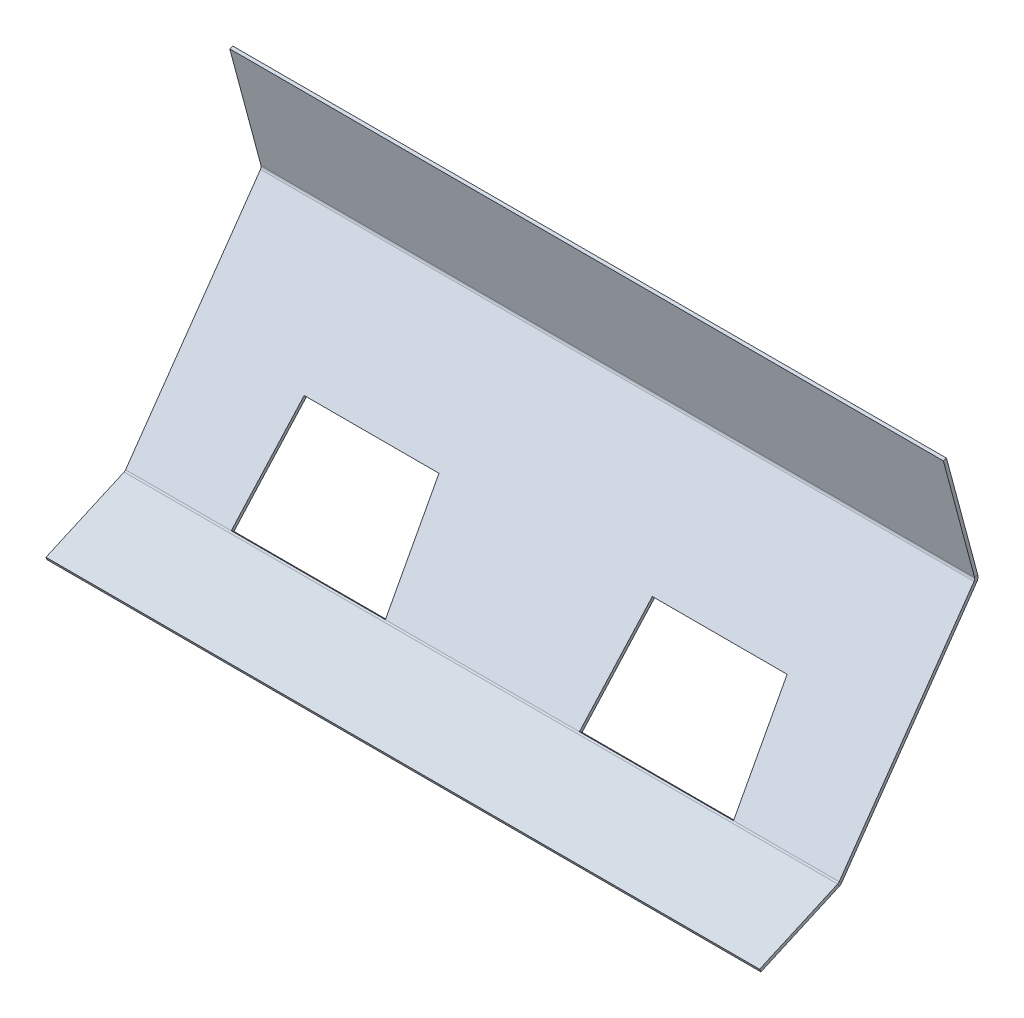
ISO-10303-21;
HEADER;
FILE_DESCRIPTION(('STEP AP214'),'2;1');
FILE_NAME('part.step','',(''),(''),'','','');
FILE_SCHEMA(('AUTOMOTIVE_DESIGN { 1 0 10303 214 1 1 1 1 }'));
ENDSEC;
DATA;
#1=APPLICATION_CONTEXT('core data for automotive mechanical design processes');
#2=APPLICATION_PROTOCOL_DEFINITION('international standard','automotive_design',2000,#1);
#3=PRODUCT_CONTEXT('',#1,'mechanical');
#4=PRODUCT('Part','Part','',(#3));
#5=PRODUCT_RELATED_PRODUCT_CATEGORY('part','',(#4));
#6=PRODUCT_DEFINITION_FORMATION('','',#4);
#7=PRODUCT_DEFINITION_CONTEXT('part definition',#1,'design');
#8=PRODUCT_DEFINITION('design','',#6,#7);
#9=PRODUCT_DEFINITION_SHAPE('','',#8);
#10=(LENGTH_UNIT() NAMED_UNIT(*) SI_UNIT(.MILLI.,.METRE.));
#11=(NAMED_UNIT(*) PLANE_ANGLE_UNIT() SI_UNIT($,.RADIAN.));
#12=(NAMED_UNIT(*) SI_UNIT($,.STERADIAN.) SOLID_ANGLE_UNIT());
#13=UNCERTAINTY_MEASURE_WITH_UNIT(LENGTH_MEASURE(1.E-05),#10,'distance_accuracy_value','');
#14=(GEOMETRIC_REPRESENTATION_CONTEXT(3) GLOBAL_UNCERTAINTY_ASSIGNED_CONTEXT((#13)) GLOBAL_UNIT_ASSIGNED_CONTEXT((#10,
#11,#12)) REPRESENTATION_CONTEXT('',''));
#15=CARTESIAN_POINT('',(0.,0.,0.));
#16=DIRECTION('',(0.,0.,1.));
#17=DIRECTION('',(1.,0.,0.));
#18=AXIS2_PLACEMENT_3D('',#15,#16,#17);
#19=CARTESIAN_POINT('',(-99.,-0.0563990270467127,0.126674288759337));
#20=DIRECTION('',(-1.,0.,0.));
#21=DIRECTION('',(0.,0.,1.));
#22=AXIS2_PLACEMENT_3D('',#19,#20,#21);
#23=PLANE('',#22);
#24=DIRECTION('',(0.,-0.913545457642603,-0.406736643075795));
#25=VECTOR('',#24,1.);
#26=CARTESIAN_POINT('',(-99.,-0.0563990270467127,0.126674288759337));
#27=LINE('',#26,#25);
#28=CARTESIAN_POINT('',(-99.,-0.0563990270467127,0.126674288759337));
#29=VERTEX_POINT('',#28);
#30=CARTESIAN_POINT('',(-99.,-0.467494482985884,-0.0563572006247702));
#31=VERTEX_POINT('',#30);
#32=EDGE_CURVE('E11',#29,#31,#27,.T.);
#33=ORIENTED_EDGE('',*,*,#32,.F.);
#34=CARTESIAN_POINT('',(-99.,0.400373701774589,0.330042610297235));
#35=DIRECTION('',(-1.,0.,0.));
#36=DIRECTION('',(0.,0.,1.));
#37=AXIS2_PLACEMENT_3D('',#34,#35,#36);
#38=CIRCLE('',#37,0.5);
#39=CARTESIAN_POINT('',(-99.,0.113585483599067,-0.0795334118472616));
#40=VERTEX_POINT('',#39);
#41=EDGE_CURVE('E282',#29,#40,#38,.F.);
#42=ORIENTED_EDGE('',*,*,#41,.T.);
#43=DIRECTION('',(0.,0.573576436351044,0.819152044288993));
#44=VECTOR('',#43,1.);
#45=CARTESIAN_POINT('',(-99.,-0.144523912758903,-0.448151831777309));
#46=LINE('',#45,#44);
#47=CARTESIAN_POINT('',(-99.,-0.144523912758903,-0.448151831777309));
#48=VERTEX_POINT('',#47);
#49=EDGE_CURVE('E56',#48,#40,#46,.T.);
#50=ORIENTED_EDGE('',*,*,#49,.F.);
#51=CARTESIAN_POINT('',(-99.,0.400373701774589,0.330042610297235));
#52=DIRECTION('',(1.,0.,0.));
#53=DIRECTION('',(0.,0.,-1.));
#54=AXIS2_PLACEMENT_3D('',#51,#52,#53);
#55=CIRCLE('',#54,0.95);
#56=EDGE_CURVE('E218',#31,#48,#55,.T.);
#57=ORIENTED_EDGE('',*,*,#56,.F.);
#58=EDGE_LOOP('',(#33,#42,#50,#57));
#59=FACE_BOUND('',#58,.T.);
#60=ADVANCED_FACE('F49',(#59),#23,.T.);
#61=CARTESIAN_POINT('',(-99.,-0.144523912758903,-0.448151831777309));
#62=DIRECTION('',(-1.,0.,0.));
#63=DIRECTION('',(0.,0.,1.));
#64=AXIS2_PLACEMENT_3D('',#61,#62,#63);
#65=PLANE('',#64);
#66=DIRECTION('',(0.,0.406736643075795,-0.913545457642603));
#67=VECTOR('',#66,1.);
#68=CARTESIAN_POINT('',(-99.,0.,0.));
#69=LINE('',#68,#67);
#70=CARTESIAN_POINT('',(-99.,-4.88083971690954,10.9625454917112));
#71=VERTEX_POINT('',#70);
#72=EDGE_CURVE('E286',#71,#29,#69,.T.);
#73=ORIENTED_EDGE('',*,*,#72,.T.);
#74=ORIENTED_EDGE('',*,*,#32,.T.);
#75=DIRECTION('',(0.,0.406736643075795,-0.913545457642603));
#76=VECTOR('',#75,1.);
#77=CARTESIAN_POINT('',(-99.,-0.411095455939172,-0.183031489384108));
#78=LINE('',#77,#76);
#79=CARTESIAN_POINT('',(-99.,-5.29193517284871,10.7795140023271));
#80=VERTEX_POINT('',#79);
#81=EDGE_CURVE('E305',#80,#31,#78,.T.);
#82=ORIENTED_EDGE('',*,*,#81,.F.);
#83=DIRECTION('',(0.,0.913545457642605,0.406736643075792));
#84=VECTOR('',#83,1.);
#85=CARTESIAN_POINT('',(-99.,-5.29193517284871,10.7795140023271));
#86=LINE('',#85,#84);
#87=EDGE_CURVE('E303',#80,#71,#86,.T.);
#88=ORIENTED_EDGE('',*,*,#87,.T.);
#89=EDGE_LOOP('',(#73,#74,#82,#88));
#90=FACE_BOUND('',#89,.T.);
#91=ADVANCED_FACE('F386',(#90),#65,.T.);
#92=CARTESIAN_POINT('',(0.,0.113585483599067,-0.0795334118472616));
#93=DIRECTION('',(1.,0.,0.));
#94=DIRECTION('',(0.,0.,-1.));
#95=AXIS2_PLACEMENT_3D('',#92,#93,#94);
#96=PLANE('',#95);
#97=DIRECTION('',(0.,-0.573576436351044,-0.819152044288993));
#98=VECTOR('',#97,1.);
#99=CARTESIAN_POINT('',(0.,0.113585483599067,-0.0795334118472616));
#100=LINE('',#99,#98);
#101=CARTESIAN_POINT('',(0.,0.113585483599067,-0.0795334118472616));
#102=VERTEX_POINT('',#101);
#103=CARTESIAN_POINT('',(0.,-0.144523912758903,-0.448151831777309));
#104=VERTEX_POINT('',#103);
#105=EDGE_CURVE('E271',#102,#104,#100,.T.);
#106=ORIENTED_EDGE('',*,*,#105,.F.);
#107=CARTESIAN_POINT('',(0.,0.400373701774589,0.330042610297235));
#108=DIRECTION('',(-1.,0.,0.));
#109=DIRECTION('',(0.,0.,1.));
#110=AXIS2_PLACEMENT_3D('',#107,#108,#109);
#111=CIRCLE('',#110,0.5);
#112=CARTESIAN_POINT('',(0.,-0.0563990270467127,0.126674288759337));
#113=VERTEX_POINT('',#112);
#114=EDGE_CURVE('E323',#113,#102,#111,.F.);
#115=ORIENTED_EDGE('',*,*,#114,.F.);
#116=DIRECTION('',(0.,0.913545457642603,0.406736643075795));
#117=VECTOR('',#116,1.);
#118=CARTESIAN_POINT('',(0.,-0.467494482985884,-0.0563572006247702));
#119=LINE('',#118,#117);
#120=CARTESIAN_POINT('',(0.,-0.467494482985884,-0.0563572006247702));
#121=VERTEX_POINT('',#120);
#122=EDGE_CURVE('E269',#121,#113,#119,.T.);
#123=ORIENTED_EDGE('',*,*,#122,.F.);
#124=CARTESIAN_POINT('',(0.,0.400373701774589,0.330042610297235));
#125=DIRECTION('',(1.,0.,0.));
#126=DIRECTION('',(0.,0.,-1.));
#127=AXIS2_PLACEMENT_3D('',#124,#125,#126);
#128=CIRCLE('',#127,0.95);
#129=EDGE_CURVE('E333',#121,#104,#128,.T.);
#130=ORIENTED_EDGE('',*,*,#129,.T.);
#131=EDGE_LOOP('',(#106,#115,#123,#130));
#132=FACE_BOUND('',#131,.T.);
#133=ADVANCED_FACE('F368',(#132),#96,.T.);
#134=CARTESIAN_POINT('',(0.,-0.467494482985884,-0.0563572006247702));
#135=DIRECTION('',(1.,0.,0.));
#136=DIRECTION('',(0.,0.,-1.));
#137=AXIS2_PLACEMENT_3D('',#134,#135,#136);
#138=PLANE('',#137);
#139=DIRECTION('',(0.,0.819152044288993,-0.573576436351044));
#140=VECTOR('',#139,1.);
#141=CARTESIAN_POINT('',(0.,0.,0.));
#142=LINE('',#141,#140);
#143=CARTESIAN_POINT('',(0.,26.8410290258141,-18.7942908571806));
#144=VERTEX_POINT('',#143);
#145=EDGE_CURVE('E321',#102,#144,#142,.T.);
#146=ORIENTED_EDGE('',*,*,#145,.F.);
#147=ORIENTED_EDGE('',*,*,#105,.T.);
#148=DIRECTION('',(0.,0.819152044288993,-0.573576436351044));
#149=VECTOR('',#148,1.);
#150=CARTESIAN_POINT('',(0.,-0.25810939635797,-0.368618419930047));
#151=LINE('',#150,#149);
#152=CARTESIAN_POINT('',(0.,26.5829196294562,-19.1629092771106));
#153=VERTEX_POINT('',#152);
#154=EDGE_CURVE('E336',#104,#153,#151,.T.);
#155=ORIENTED_EDGE('',*,*,#154,.T.);
#156=DIRECTION('',(0.,0.573576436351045,0.819152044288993));
#157=VECTOR('',#156,1.);
#158=CARTESIAN_POINT('',(0.,26.5829196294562,-19.1629092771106));
#159=LINE('',#158,#157);
#160=EDGE_CURVE('E261',#153,#144,#159,.T.);
#161=ORIENTED_EDGE('',*,*,#160,.T.);
#162=EDGE_LOOP('',(#146,#147,#155,#161));
#163=FACE_BOUND('',#162,.T.);
#164=ADVANCED_FACE('F364',(#163),#138,.T.);
#165=CARTESIAN_POINT('',(-99.,26.8410290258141,-18.7942908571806));
#166=DIRECTION('',(-1.,0.,0.));
#167=DIRECTION('',(0.,0.,1.));
#168=AXIS2_PLACEMENT_3D('',#165,#166,#167);
#169=PLANE('',#168);
#170=DIRECTION('',(0.,-0.573576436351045,-0.819152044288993));
#171=VECTOR('',#170,1.);
#172=CARTESIAN_POINT('',(-99.,26.8410290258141,-18.7942908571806));
#173=LINE('',#172,#171);
#174=CARTESIAN_POINT('',(-99.,26.8410290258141,-18.7942908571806));
#175=VERTEX_POINT('',#174);
#176=CARTESIAN_POINT('',(-99.,26.5829196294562,-19.1629092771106));
#177=VERTEX_POINT('',#176);
#178=EDGE_CURVE('E267',#175,#177,#173,.T.);
#179=ORIENTED_EDGE('',*,*,#178,.F.);
#180=CARTESIAN_POINT('',(-99.,27.1278172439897,-18.3847148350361));
#181=DIRECTION('',(-1.,0.,0.));
#182=DIRECTION('',(0.,0.,1.));
#183=AXIS2_PLACEMENT_3D('',#180,#181,#182);
#184=CIRCLE('',#183,0.5);
#185=CARTESIAN_POINT('',(-99.,27.2572267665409,-18.8676777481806));
#186=VERTEX_POINT('',#185);
#187=EDGE_CURVE('E295',#175,#186,#184,.F.);
#188=ORIENTED_EDGE('',*,*,#187,.T.);
#189=DIRECTION('',(0.,-0.258819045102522,0.965925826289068));
#190=VECTOR('',#189,1.);
#191=CARTESIAN_POINT('',(-99.,27.3736953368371,-19.3023443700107));
#192=LINE('',#191,#190);
#193=CARTESIAN_POINT('',(-99.,27.3736953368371,-19.3023443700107));
#194=VERTEX_POINT('',#193);
#195=EDGE_CURVE('E265',#194,#186,#192,.T.);
#196=ORIENTED_EDGE('',*,*,#195,.F.);
#197=CARTESIAN_POINT('',(-99.,27.1278172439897,-18.3847148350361));
#198=DIRECTION('',(1.,0.,0.));
#199=DIRECTION('',(0.,0.,-1.));
#200=AXIS2_PLACEMENT_3D('',#197,#198,#199);
#201=CIRCLE('',#200,0.95);
#202=EDGE_CURVE('E260',#177,#194,#201,.T.);
#203=ORIENTED_EDGE('',*,*,#202,.F.);
#204=EDGE_LOOP('',(#179,#188,#196,#203));
#205=FACE_BOUND('',#204,.T.);
#206=ADVANCED_FACE('F396',(#205),#169,.T.);
#207=CARTESIAN_POINT('',(-99.,27.3736953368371,-19.3023443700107));
#208=DIRECTION('',(-1.,0.,0.));
#209=DIRECTION('',(0.,0.,1.));
#210=AXIS2_PLACEMENT_3D('',#207,#208,#209);
#211=PLANE('',#210);
#212=DIRECTION('',(0.,0.819152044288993,-0.573576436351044));
#213=VECTOR('',#212,1.);
#214=CARTESIAN_POINT('',(-99.,0.,0.));
#215=LINE('',#214,#213);
#216=EDGE_CURVE('E277',#40,#175,#215,.T.);
#217=ORIENTED_EDGE('',*,*,#216,.T.);
#218=ORIENTED_EDGE('',*,*,#178,.T.);
#219=DIRECTION('',(0.,0.819152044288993,-0.573576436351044));
#220=VECTOR('',#219,1.);
#221=CARTESIAN_POINT('',(-99.,-0.25810939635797,-0.368618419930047));
#222=LINE('',#221,#220);
#223=EDGE_CURVE('E279',#48,#177,#222,.T.);
#224=ORIENTED_EDGE('',*,*,#223,.F.);
#225=ORIENTED_EDGE('',*,*,#49,.T.);
#226=EDGE_LOOP('',(#217,#218,#224,#225));
#227=FACE_BOUND('',#226,.T.);
#228=ADVANCED_FACE('F275',(#227),#211,.T.);
#229=CARTESIAN_POINT('',(0.,27.2572267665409,-18.8676777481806));
#230=DIRECTION('',(1.,0.,0.));
#231=DIRECTION('',(0.,0.,-1.));
#232=AXIS2_PLACEMENT_3D('',#229,#230,#231);
#233=PLANE('',#232);
#234=DIRECTION('',(0.,0.258819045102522,-0.965925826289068));
#235=VECTOR('',#234,1.);
#236=CARTESIAN_POINT('',(0.,27.2572267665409,-18.8676777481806));
#237=LINE('',#236,#235);
#238=CARTESIAN_POINT('',(0.,27.2572267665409,-18.8676777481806));
#239=VERTEX_POINT('',#238);
#240=CARTESIAN_POINT('',(0.,27.3736953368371,-19.3023443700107));
#241=VERTEX_POINT('',#240);
#242=EDGE_CURVE('E263',#239,#241,#237,.T.);
#243=ORIENTED_EDGE('',*,*,#242,.F.);
#244=CARTESIAN_POINT('',(0.,27.1278172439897,-18.3847148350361));
#245=DIRECTION('',(-1.,0.,0.));
#246=DIRECTION('',(0.,0.,1.));
#247=AXIS2_PLACEMENT_3D('',#244,#245,#246);
#248=CIRCLE('',#247,0.5);
#249=EDGE_CURVE('E318',#144,#239,#248,.F.);
#250=ORIENTED_EDGE('',*,*,#249,.F.);
#251=ORIENTED_EDGE('',*,*,#160,.F.);
#252=CARTESIAN_POINT('',(0.,27.1278172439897,-18.3847148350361));
#253=DIRECTION('',(1.,0.,0.));
#254=DIRECTION('',(0.,0.,-1.));
#255=AXIS2_PLACEMENT_3D('',#252,#253,#254);
#256=CIRCLE('',#255,0.95);
#257=EDGE_CURVE('E339',#153,#241,#256,.T.);
#258=ORIENTED_EDGE('',*,*,#257,.T.);
#259=EDGE_LOOP('',(#243,#250,#251,#258));
#260=FACE_BOUND('',#259,.T.);
#261=ADVANCED_FACE('F359',(#260),#233,.T.);
#262=CARTESIAN_POINT('',(0.,26.5829196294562,-19.1629092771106));
#263=DIRECTION('',(1.,0.,0.));
#264=DIRECTION('',(0.,0.,-1.));
#265=AXIS2_PLACEMENT_3D('',#262,#263,#264);
#266=PLANE('',#265);
#267=DIRECTION('',(0.,0.965925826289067,0.258819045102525));
#268=VECTOR('',#267,1.);
#269=CARTESIAN_POINT('',(0.,27.0320174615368,-18.9280223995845));
#270=LINE('',#269,#268);
#271=CARTESIAN_POINT('',(0.,43.4527565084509,-14.5280986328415));
#272=VERTEX_POINT('',#271);
#273=EDGE_CURVE('E316',#239,#272,#270,.T.);
#274=ORIENTED_EDGE('',*,*,#273,.F.);
#275=ORIENTED_EDGE('',*,*,#242,.T.);
#276=DIRECTION('',(0.,0.965925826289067,0.258819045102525));
#277=VECTOR('',#276,1.);
#278=CARTESIAN_POINT('',(0.,27.1484860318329,-19.3626890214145));
#279=LINE('',#278,#277);
#280=CARTESIAN_POINT('',(0.,43.5692250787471,-14.9627652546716));
#281=VERTEX_POINT('',#280);
#282=EDGE_CURVE('E191',#241,#281,#279,.T.);
#283=ORIENTED_EDGE('',*,*,#282,.T.);
#284=DIRECTION('',(0.,0.258819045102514,-0.96592582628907));
#285=VECTOR('',#284,1.);
#286=CARTESIAN_POINT('',(0.,43.4527565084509,-14.5280986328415));
#287=LINE('',#286,#285);
#288=EDGE_CURVE('E313',#272,#281,#287,.T.);
#289=ORIENTED_EDGE('',*,*,#288,.F.);
#290=EDGE_LOOP('',(#274,#275,#283,#289));
#291=FACE_BOUND('',#290,.T.);
#292=ADVANCED_FACE('F404',(#291),#266,.T.);
#293=CARTESIAN_POINT('',(-99.,27.1484860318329,-19.3626890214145));
#294=DIRECTION('',(0.,0.258819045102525,-0.965925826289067));
#295=DIRECTION('',(0.,0.965925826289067,0.258819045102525));
#296=AXIS2_PLACEMENT_3D('',#293,#294,#295);
#297=PLANE('',#296);
#298=ORIENTED_EDGE('',*,*,#282,.F.);
#299=DIRECTION('',(1.,0.,0.));
#300=VECTOR('',#299,1.);
#301=CARTESIAN_POINT('',(-99.,27.3736953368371,-19.3023443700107));
#302=LINE('',#301,#300);
#303=EDGE_CURVE('E224',#194,#241,#302,.T.);
#304=ORIENTED_EDGE('',*,*,#303,.F.);
#305=DIRECTION('',(0.,0.965925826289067,0.258819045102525));
#306=VECTOR('',#305,1.);
#307=CARTESIAN_POINT('',(-99.,27.1484860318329,-19.3626890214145));
#308=LINE('',#307,#306);
#309=CARTESIAN_POINT('',(-99.,43.5692250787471,-14.9627652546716));
#310=VERTEX_POINT('',#309);
#311=EDGE_CURVE('E342',#194,#310,#308,.T.);
#312=ORIENTED_EDGE('',*,*,#311,.T.);
#313=DIRECTION('',(1.,0.,0.));
#314=VECTOR('',#313,1.);
#315=CARTESIAN_POINT('',(-99.,43.5692250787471,-14.9627652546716));
#316=LINE('',#315,#314);
#317=EDGE_CURVE('E258',#310,#281,#316,.T.);
#318=ORIENTED_EDGE('',*,*,#317,.T.);
#319=EDGE_LOOP('',(#298,#304,#312,#318));
#320=FACE_BOUND('',#319,.T.);
#321=ADVANCED_FACE('F354',(#320),#297,.T.);
#322=CARTESIAN_POINT('',(-99.,27.1278172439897,-18.3847148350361));
#323=DIRECTION('',(1.,0.,0.));
#324=DIRECTION('',(0.,0.,-1.));
#325=AXIS2_PLACEMENT_3D('',#322,#323,#324);
#326=CYLINDRICAL_SURFACE('',#325,0.95);
#327=ORIENTED_EDGE('',*,*,#257,.F.);
#328=DIRECTION('',(1.,0.,0.));
#329=VECTOR('',#328,1.);
#330=CARTESIAN_POINT('',(-99.,26.5829196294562,-19.1629092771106));
#331=LINE('',#330,#329);
#332=EDGE_CURVE('E219',#177,#153,#331,.T.);
#333=ORIENTED_EDGE('',*,*,#332,.F.);
#334=ORIENTED_EDGE('',*,*,#202,.T.);
#335=ORIENTED_EDGE('',*,*,#303,.T.);
#336=EDGE_LOOP('',(#327,#333,#334,#335));
#337=FACE_BOUND('',#336,.T.);
#338=ADVANCED_FACE('F348',(#337),#326,.T.);
#339=CARTESIAN_POINT('',(-99.,-0.25810939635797,-0.368618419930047));
#340=DIRECTION('',(0.,-0.573576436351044,-0.819152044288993));
#341=DIRECTION('',(0.,0.819152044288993,-0.573576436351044));
#342=AXIS2_PLACEMENT_3D('',#339,#340,#341);
#343=PLANE('',#342);
#344=DIRECTION('',(-0.0871557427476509,-0.81603492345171,0.571393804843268));
#345=VECTOR('',#344,1.);
#346=CARTESIAN_POINT('',(-83.,12.3885023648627,-9.22387130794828));
#347=LINE('',#346,#345);
#348=CARTESIAN_POINT('',(-83.,12.3885023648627,-9.22387130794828));
#349=VERTEX_POINT('',#348);
#350=CARTESIAN_POINT('',(-84.3385765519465,-0.144523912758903,-0.448151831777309));
#351=VERTEX_POINT('',#350);
#352=EDGE_CURVE('E196',#349,#351,#347,.T.);
#353=ORIENTED_EDGE('',*,*,#352,.T.);
#354=DIRECTION('',(1.,0.,0.));
#355=VECTOR('',#354,1.);
#356=CARTESIAN_POINT('',(-99.,-0.144523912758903,-0.448151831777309));
#357=LINE('',#356,#355);
#358=EDGE_CURVE('E207',#48,#351,#357,.T.);
#359=ORIENTED_EDGE('',*,*,#358,.F.);
#360=ORIENTED_EDGE('',*,*,#223,.T.);
#361=ORIENTED_EDGE('',*,*,#332,.T.);
#362=ORIENTED_EDGE('',*,*,#154,.F.);
#363=CARTESIAN_POINT('',(-14.6614234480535,-0.144523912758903,-0.448151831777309));
#364=VERTEX_POINT('',#363);
#365=EDGE_CURVE('E222',#364,#104,#357,.T.);
#366=ORIENTED_EDGE('',*,*,#365,.F.);
#367=DIRECTION('',(-0.0871557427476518,0.81603492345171,-0.571393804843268));
#368=VECTOR('',#367,1.);
#369=CARTESIAN_POINT('',(-16.,12.3885023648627,-9.22387130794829));
#370=LINE('',#369,#368);
#371=CARTESIAN_POINT('',(-16.,12.3885023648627,-9.22387130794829));
#372=VERTEX_POINT('',#371);
#373=EDGE_CURVE('E757',#364,#372,#370,.T.);
#374=ORIENTED_EDGE('',*,*,#373,.T.);
#375=DIRECTION('',(-1.,0.,0.));
#376=VECTOR('',#375,1.);
#377=CARTESIAN_POINT('',(-16.,12.3885023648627,-9.22387130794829));
#378=LINE('',#377,#376);
#379=CARTESIAN_POINT('',(-34.7,12.3885023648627,-9.22387130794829));
#380=VERTEX_POINT('',#379);
#381=EDGE_CURVE('E760',#372,#380,#378,.T.);
#382=ORIENTED_EDGE('',*,*,#381,.T.);
#383=DIRECTION('',(-0.0871557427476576,-0.81603492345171,0.571393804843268));
#384=VECTOR('',#383,1.);
#385=CARTESIAN_POINT('',(-34.7,12.3885023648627,-9.22387130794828));
#386=LINE('',#385,#384);
#387=CARTESIAN_POINT('',(-36.0385765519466,-0.144523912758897,-0.448151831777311));
#388=VERTEX_POINT('',#387);
#389=EDGE_CURVE('E736',#380,#388,#386,.T.);
#390=ORIENTED_EDGE('',*,*,#389,.T.);
#391=CARTESIAN_POINT('',(-62.9614234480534,-0.144523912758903,-0.448151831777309));
#392=VERTEX_POINT('',#391);
#393=EDGE_CURVE('E220',#392,#388,#357,.T.);
#394=ORIENTED_EDGE('',*,*,#393,.F.);
#395=DIRECTION('',(-0.087155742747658,0.81603492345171,-0.571393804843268));
#396=VECTOR('',#395,1.);
#397=CARTESIAN_POINT('',(-64.3,12.3885023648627,-9.22387130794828));
#398=LINE('',#397,#396);
#399=CARTESIAN_POINT('',(-64.3,12.3885023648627,-9.22387130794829));
#400=VERTEX_POINT('',#399);
#401=EDGE_CURVE('E765',#392,#400,#398,.T.);
#402=ORIENTED_EDGE('',*,*,#401,.T.);
#403=DIRECTION('',(-1.,0.,0.));
#404=VECTOR('',#403,1.);
#405=CARTESIAN_POINT('',(-83.,12.3885023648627,-9.22387130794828));
#406=LINE('',#405,#404);
#407=EDGE_CURVE('E210',#400,#349,#406,.T.);
#408=ORIENTED_EDGE('',*,*,#407,.T.);
#409=EDGE_LOOP('',(#353,#359,#360,#361,#362,#366,#374,#382,#390,#394,#402,#408));
#410=FACE_BOUND('',#409,.T.);
#411=ADVANCED_FACE('F205',(#410),#343,.T.);
#412=CARTESIAN_POINT('',(-99.,0.400373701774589,0.330042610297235));
#413=DIRECTION('',(1.,0.,0.));
#414=DIRECTION('',(0.,0.,-1.));
#415=AXIS2_PLACEMENT_3D('',#412,#413,#414);
#416=CYLINDRICAL_SURFACE('',#415,0.95);
#417=ORIENTED_EDGE('',*,*,#129,.F.);
#418=DIRECTION('',(1.,0.,0.));
#419=VECTOR('',#418,1.);
#420=CARTESIAN_POINT('',(-99.,-0.467494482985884,-0.0563572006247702));
#421=LINE('',#420,#419);
#422=EDGE_CURVE('E227',#31,#121,#421,.T.);
#423=ORIENTED_EDGE('',*,*,#422,.F.);
#424=ORIENTED_EDGE('',*,*,#56,.T.);
#425=ORIENTED_EDGE('',*,*,#358,.T.);
#426=DIRECTION('',(1.,0.,0.));
#427=VECTOR('',#426,1.);
#428=CARTESIAN_POINT('',(-99.,-0.144523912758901,-0.44815183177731));
#429=LINE('',#428,#427);
#430=EDGE_CURVE('E183',#351,#392,#429,.T.);
#431=ORIENTED_EDGE('',*,*,#430,.T.);
#432=ORIENTED_EDGE('',*,*,#393,.T.);
#433=DIRECTION('',(1.,0.,0.));
#434=VECTOR('',#433,1.);
#435=CARTESIAN_POINT('',(-99.,-0.144523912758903,-0.448151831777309));
#436=LINE('',#435,#434);
#437=EDGE_CURVE('E763',#388,#364,#436,.T.);
#438=ORIENTED_EDGE('',*,*,#437,.T.);
#439=ORIENTED_EDGE('',*,*,#365,.T.);
#440=EDGE_LOOP('',(#417,#423,#424,#425,#431,#432,#438,#439));
#441=FACE_BOUND('',#440,.T.);
#442=ADVANCED_FACE('F215',(#441),#416,.T.);
#443=CARTESIAN_POINT('',(-99.,-0.411095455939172,-0.183031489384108));
#444=DIRECTION('',(0.,-0.913545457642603,-0.406736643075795));
#445=DIRECTION('',(0.,0.406736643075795,-0.913545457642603));
#446=AXIS2_PLACEMENT_3D('',#443,#444,#445);
#447=PLANE('',#446);
#448=DIRECTION('',(0.,0.406736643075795,-0.913545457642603));
#449=VECTOR('',#448,1.);
#450=CARTESIAN_POINT('',(0.,-0.411095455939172,-0.183031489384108));
#451=LINE('',#450,#449);
#452=CARTESIAN_POINT('',(0.,-5.29193517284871,10.7795140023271));
#453=VERTEX_POINT('',#452);
#454=EDGE_CURVE('E330',#453,#121,#451,.T.);
#455=ORIENTED_EDGE('',*,*,#454,.F.);
#456=DIRECTION('',(1.,0.,0.));
#457=VECTOR('',#456,1.);
#458=CARTESIAN_POINT('',(-99.,-5.29193517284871,10.7795140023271));
#459=LINE('',#458,#457);
#460=EDGE_CURVE('E232',#80,#453,#459,.T.);
#461=ORIENTED_EDGE('',*,*,#460,.F.);
#462=ORIENTED_EDGE('',*,*,#81,.T.);
#463=ORIENTED_EDGE('',*,*,#422,.T.);
#464=EDGE_LOOP('',(#455,#461,#462,#463));
#465=FACE_BOUND('',#464,.T.);
#466=ADVANCED_FACE('F380',(#465),#447,.T.);
#467=CARTESIAN_POINT('',(-99.,-5.29193517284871,10.7795140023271));
#468=DIRECTION('',(0.,0.406736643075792,-0.913545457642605));
#469=DIRECTION('',(0.,0.913545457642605,0.406736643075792));
#470=AXIS2_PLACEMENT_3D('',#467,#468,#469);
#471=PLANE('',#470);
#472=DIRECTION('',(0.,0.913545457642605,0.406736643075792));
#473=VECTOR('',#472,1.);
#474=CARTESIAN_POINT('',(0.,-5.29193517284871,10.7795140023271));
#475=LINE('',#474,#473);
#476=CARTESIAN_POINT('',(0.,-4.88083971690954,10.9625454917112));
#477=VERTEX_POINT('',#476);
#478=EDGE_CURVE('E328',#453,#477,#475,.T.);
#479=ORIENTED_EDGE('',*,*,#478,.T.);
#480=DIRECTION('',(1.,0.,0.));
#481=VECTOR('',#480,1.);
#482=CARTESIAN_POINT('',(-99.,-4.88083971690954,10.9625454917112));
#483=LINE('',#482,#481);
#484=EDGE_CURVE('E236',#71,#477,#483,.T.);
#485=ORIENTED_EDGE('',*,*,#484,.F.);
#486=ORIENTED_EDGE('',*,*,#87,.F.);
#487=ORIENTED_EDGE('',*,*,#460,.T.);
#488=EDGE_LOOP('',(#479,#485,#486,#487));
#489=FACE_BOUND('',#488,.T.);
#490=ADVANCED_FACE('F384',(#489),#471,.F.);
#491=CARTESIAN_POINT('',(-99.,0.,0.));
#492=DIRECTION('',(0.,-0.913545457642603,-0.406736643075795));
#493=DIRECTION('',(0.,0.406736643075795,-0.913545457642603));
#494=AXIS2_PLACEMENT_3D('',#491,#492,#493);
#495=PLANE('',#494);
#496=DIRECTION('',(0.,0.406736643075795,-0.913545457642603));
#497=VECTOR('',#496,1.);
#498=CARTESIAN_POINT('',(0.,0.,0.));
#499=LINE('',#498,#497);
#500=EDGE_CURVE('E325',#477,#113,#499,.T.);
#501=ORIENTED_EDGE('',*,*,#500,.T.);
#502=DIRECTION('',(1.,0.,0.));
#503=VECTOR('',#502,1.);
#504=CARTESIAN_POINT('',(-99.,-0.0563990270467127,0.126674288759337));
#505=LINE('',#504,#503);
#506=EDGE_CURVE('E241',#29,#113,#505,.T.);
#507=ORIENTED_EDGE('',*,*,#506,.F.);
#508=ORIENTED_EDGE('',*,*,#72,.F.);
#509=ORIENTED_EDGE('',*,*,#484,.T.);
#510=EDGE_LOOP('',(#501,#507,#508,#509));
#511=FACE_BOUND('',#510,.T.);
#512=ADVANCED_FACE('F374',(#511),#495,.F.);
#513=CARTESIAN_POINT('',(-99.,0.400373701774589,0.330042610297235));
#514=DIRECTION('',(1.,0.,0.));
#515=DIRECTION('',(0.,0.,-1.));
#516=AXIS2_PLACEMENT_3D('',#513,#514,#515);
#517=CYLINDRICAL_SURFACE('',#516,0.5);
#518=ORIENTED_EDGE('',*,*,#114,.T.);
#519=DIRECTION('',(1.,0.,0.));
#520=VECTOR('',#519,1.);
#521=CARTESIAN_POINT('',(-99.,0.113585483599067,-0.0795334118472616));
#522=LINE('',#521,#520);
#523=CARTESIAN_POINT('',(-14.6614234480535,0.113585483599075,-0.079533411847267));
#524=VERTEX_POINT('',#523);
#525=EDGE_CURVE('E248',#524,#102,#522,.T.);
#526=ORIENTED_EDGE('',*,*,#525,.F.);
#527=DIRECTION('',(1.,0.,0.));
#528=VECTOR('',#527,1.);
#529=CARTESIAN_POINT('',(-14.6614234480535,0.113585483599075,-0.079533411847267));
#530=LINE('',#529,#528);
#531=CARTESIAN_POINT('',(-36.0385765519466,0.113585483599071,-0.0795334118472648));
#532=VERTEX_POINT('',#531);
#533=EDGE_CURVE('E750',#532,#524,#530,.T.);
#534=ORIENTED_EDGE('',*,*,#533,.F.);
#535=CARTESIAN_POINT('',(-62.9614234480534,0.113585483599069,-0.0795334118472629));
#536=VERTEX_POINT('',#535);
#537=EDGE_CURVE('E247',#536,#532,#522,.T.);
#538=ORIENTED_EDGE('',*,*,#537,.F.);
#539=DIRECTION('',(1.,0.,0.));
#540=VECTOR('',#539,1.);
#541=CARTESIAN_POINT('',(-62.9614234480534,0.113585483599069,-0.0795334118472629));
#542=LINE('',#541,#540);
#543=CARTESIAN_POINT('',(-84.3385765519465,0.113585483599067,-0.0795334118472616));
#544=VERTEX_POINT('',#543);
#545=EDGE_CURVE('E211',#544,#536,#542,.T.);
#546=ORIENTED_EDGE('',*,*,#545,.F.);
#547=EDGE_CURVE('E244',#40,#544,#522,.T.);
#548=ORIENTED_EDGE('',*,*,#547,.F.);
#549=ORIENTED_EDGE('',*,*,#41,.F.);
#550=ORIENTED_EDGE('',*,*,#506,.T.);
#551=EDGE_LOOP('',(#518,#526,#534,#538,#546,#548,#549,#550));
#552=FACE_BOUND('',#551,.T.);
#553=ADVANCED_FACE('F289',(#552),#517,.F.);
#554=CARTESIAN_POINT('',(-99.,0.,0.));
#555=DIRECTION('',(0.,-0.573576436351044,-0.819152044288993));
#556=DIRECTION('',(0.,0.819152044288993,-0.573576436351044));
#557=AXIS2_PLACEMENT_3D('',#554,#555,#556);
#558=PLANE('',#557);
#559=ORIENTED_EDGE('',*,*,#547,.T.);
#560=DIRECTION('',(-0.0871557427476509,-0.81603492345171,0.571393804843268));
#561=VECTOR('',#560,1.);
#562=CARTESIAN_POINT('',(-83.,12.6466117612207,-8.85525288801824));
#563=LINE('',#562,#561);
#564=CARTESIAN_POINT('',(-83.,12.6466117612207,-8.85525288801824));
#565=VERTEX_POINT('',#564);
#566=EDGE_CURVE('E199',#565,#544,#563,.T.);
#567=ORIENTED_EDGE('',*,*,#566,.F.);
#568=DIRECTION('',(-1.,0.,0.));
#569=VECTOR('',#568,1.);
#570=CARTESIAN_POINT('',(-83.,12.6466117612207,-8.85525288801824));
#571=LINE('',#570,#569);
#572=CARTESIAN_POINT('',(-64.3,12.6466117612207,-8.85525288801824));
#573=VERTEX_POINT('',#572);
#574=EDGE_CURVE('E724',#573,#565,#571,.T.);
#575=ORIENTED_EDGE('',*,*,#574,.F.);
#576=DIRECTION('',(-0.087155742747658,0.81603492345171,-0.571393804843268));
#577=VECTOR('',#576,1.);
#578=CARTESIAN_POINT('',(-64.3,12.6466117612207,-8.85525288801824));
#579=LINE('',#578,#577);
#580=EDGE_CURVE('E727',#536,#573,#579,.T.);
#581=ORIENTED_EDGE('',*,*,#580,.F.);
#582=ORIENTED_EDGE('',*,*,#537,.T.);
#583=DIRECTION('',(-0.0871557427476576,-0.81603492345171,0.571393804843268));
#584=VECTOR('',#583,1.);
#585=CARTESIAN_POINT('',(-34.7,12.6466117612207,-8.85525288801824));
#586=LINE('',#585,#584);
#587=CARTESIAN_POINT('',(-34.7,12.6466117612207,-8.85525288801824));
#588=VERTEX_POINT('',#587);
#589=EDGE_CURVE('E752',#588,#532,#586,.T.);
#590=ORIENTED_EDGE('',*,*,#589,.F.);
#591=DIRECTION('',(-1.,0.,0.));
#592=VECTOR('',#591,1.);
#593=CARTESIAN_POINT('',(-16.,12.6466117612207,-8.85525288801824));
#594=LINE('',#593,#592);
#595=CARTESIAN_POINT('',(-16.,12.6466117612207,-8.85525288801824));
#596=VERTEX_POINT('',#595);
#597=EDGE_CURVE('E755',#596,#588,#594,.T.);
#598=ORIENTED_EDGE('',*,*,#597,.F.);
#599=DIRECTION('',(-0.0871557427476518,0.81603492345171,-0.571393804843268));
#600=VECTOR('',#599,1.);
#601=CARTESIAN_POINT('',(-16.,12.6466117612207,-8.85525288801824));
#602=LINE('',#601,#600);
#603=EDGE_CURVE('E743',#524,#596,#602,.T.);
#604=ORIENTED_EDGE('',*,*,#603,.F.);
#605=ORIENTED_EDGE('',*,*,#525,.T.);
#606=ORIENTED_EDGE('',*,*,#145,.T.);
#607=DIRECTION('',(1.,0.,0.));
#608=VECTOR('',#607,1.);
#609=CARTESIAN_POINT('',(-99.,26.8410290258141,-18.7942908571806));
#610=LINE('',#609,#608);
#611=EDGE_CURVE('E249',#175,#144,#610,.T.);
#612=ORIENTED_EDGE('',*,*,#611,.F.);
#613=ORIENTED_EDGE('',*,*,#216,.F.);
#614=EDGE_LOOP('',(#559,#567,#575,#581,#582,#590,#598,#604,#605,#606,#612,#613));
#615=FACE_BOUND('',#614,.T.);
#616=ADVANCED_FACE('F292',(#615),#558,.F.);
#617=CARTESIAN_POINT('',(-99.,27.1278172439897,-18.3847148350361));
#618=DIRECTION('',(1.,0.,0.));
#619=DIRECTION('',(0.,0.,-1.));
#620=AXIS2_PLACEMENT_3D('',#617,#618,#619);
#621=CYLINDRICAL_SURFACE('',#620,0.5);
#622=ORIENTED_EDGE('',*,*,#249,.T.);
#623=DIRECTION('',(1.,0.,0.));
#624=VECTOR('',#623,1.);
#625=CARTESIAN_POINT('',(-99.,27.2572267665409,-18.8676777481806));
#626=LINE('',#625,#624);
#627=EDGE_CURVE('E252',#186,#239,#626,.T.);
#628=ORIENTED_EDGE('',*,*,#627,.F.);
#629=ORIENTED_EDGE('',*,*,#187,.F.);
#630=ORIENTED_EDGE('',*,*,#611,.T.);
#631=EDGE_LOOP('',(#622,#628,#629,#630));
#632=FACE_BOUND('',#631,.T.);
#633=ADVANCED_FACE('F417',(#632),#621,.F.);
#634=CARTESIAN_POINT('',(-99.,27.0320174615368,-18.9280223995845));
#635=DIRECTION('',(0.,0.258819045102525,-0.965925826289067));
#636=DIRECTION('',(0.,0.965925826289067,0.258819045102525));
#637=AXIS2_PLACEMENT_3D('',#634,#635,#636);
#638=PLANE('',#637);
#639=ORIENTED_EDGE('',*,*,#273,.T.);
#640=DIRECTION('',(1.,0.,0.));
#641=VECTOR('',#640,1.);
#642=CARTESIAN_POINT('',(-99.,43.4527565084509,-14.5280986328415));
#643=LINE('',#642,#641);
#644=CARTESIAN_POINT('',(-99.,43.4527565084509,-14.5280986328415));
#645=VERTEX_POINT('',#644);
#646=EDGE_CURVE('E255',#645,#272,#643,.T.);
#647=ORIENTED_EDGE('',*,*,#646,.F.);
#648=DIRECTION('',(0.,0.965925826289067,0.258819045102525));
#649=VECTOR('',#648,1.);
#650=CARTESIAN_POINT('',(-99.,27.0320174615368,-18.9280223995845));
#651=LINE('',#650,#649);
#652=EDGE_CURVE('E298',#186,#645,#651,.T.);
#653=ORIENTED_EDGE('',*,*,#652,.F.);
#654=ORIENTED_EDGE('',*,*,#627,.T.);
#655=EDGE_LOOP('',(#639,#647,#653,#654));
#656=FACE_BOUND('',#655,.T.);
#657=ADVANCED_FACE('F413',(#656),#638,.F.);
#658=CARTESIAN_POINT('',(-99.,43.4527565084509,-14.5280986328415));
#659=DIRECTION('',(0.,-0.96592582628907,-0.258819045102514));
#660=DIRECTION('',(0.,0.258819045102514,-0.96592582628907));
#661=AXIS2_PLACEMENT_3D('',#658,#659,#660);
#662=PLANE('',#661);
#663=ORIENTED_EDGE('',*,*,#288,.T.);
#664=ORIENTED_EDGE('',*,*,#317,.F.);
#665=DIRECTION('',(0.,0.258819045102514,-0.96592582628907));
#666=VECTOR('',#665,1.);
#667=CARTESIAN_POINT('',(-99.,43.4527565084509,-14.5280986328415));
#668=LINE('',#667,#666);
#669=EDGE_CURVE('E767',#645,#310,#668,.T.);
#670=ORIENTED_EDGE('',*,*,#669,.F.);
#671=ORIENTED_EDGE('',*,*,#646,.T.);
#672=EDGE_LOOP('',(#663,#664,#670,#671));
#673=FACE_BOUND('',#672,.T.);
#674=ADVANCED_FACE('F409',(#673),#662,.F.);
#675=CARTESIAN_POINT('',(-99.,27.1278172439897,-18.3847148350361));
#676=DIRECTION('',(-1.,0.,0.));
#677=DIRECTION('',(0.,0.,1.));
#678=AXIS2_PLACEMENT_3D('',#675,#676,#677);
#679=PLANE('',#678);
#680=ORIENTED_EDGE('',*,*,#311,.F.);
#681=ORIENTED_EDGE('',*,*,#195,.T.);
#682=ORIENTED_EDGE('',*,*,#652,.T.);
#683=ORIENTED_EDGE('',*,*,#669,.T.);
#684=EDGE_LOOP('',(#680,#681,#682,#683));
#685=FACE_BOUND('',#684,.T.);
#686=ADVANCED_FACE('F412',(#685),#679,.T.);
#687=CARTESIAN_POINT('',(0.,27.1278172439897,-18.3847148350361));
#688=DIRECTION('',(-1.,0.,0.));
#689=DIRECTION('',(0.,0.,1.));
#690=AXIS2_PLACEMENT_3D('',#687,#688,#689);
#691=PLANE('',#690);
#692=ORIENTED_EDGE('',*,*,#454,.T.);
#693=ORIENTED_EDGE('',*,*,#122,.T.);
#694=ORIENTED_EDGE('',*,*,#500,.F.);
#695=ORIENTED_EDGE('',*,*,#478,.F.);
#696=EDGE_LOOP('',(#692,#693,#694,#695));
#697=FACE_BOUND('',#696,.T.);
#698=ADVANCED_FACE('F379',(#697),#691,.F.);
#699=CARTESIAN_POINT('',(-16.,1.82047512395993,-24.31657834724));
#700=DIRECTION('',(0.,0.819152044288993,-0.573576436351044));
#701=DIRECTION('',(0.,0.573576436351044,0.819152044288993));
#702=AXIS2_PLACEMENT_3D('',#699,#700,#701);
#703=PLANE('',#702);
#704=DIRECTION('',(0.,0.573576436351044,0.819152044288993));
#705=VECTOR('',#704,1.);
#706=CARTESIAN_POINT('',(-16.,1.82047512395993,-24.31657834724));
#707=LINE('',#706,#705);
#708=EDGE_CURVE('E739',#372,#596,#707,.T.);
#709=ORIENTED_EDGE('',*,*,#708,.T.);
#710=ORIENTED_EDGE('',*,*,#597,.T.);
#711=DIRECTION('',(0.,0.573576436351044,0.819152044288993));
#712=VECTOR('',#711,1.);
#713=CARTESIAN_POINT('',(-34.7,1.82047512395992,-24.31657834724));
#714=LINE('',#713,#712);
#715=EDGE_CURVE('E740',#380,#588,#714,.T.);
#716=ORIENTED_EDGE('',*,*,#715,.F.);
#717=ORIENTED_EDGE('',*,*,#381,.F.);
#718=EDGE_LOOP('',(#709,#710,#716,#717));
#719=FACE_BOUND('',#718,.T.);
#720=ADVANCED_FACE('F440',(#719),#703,.F.);
#721=CARTESIAN_POINT('',(-16.,1.82047512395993,-24.31657834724));
#722=DIRECTION('',(0.996194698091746,0.0713938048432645,-0.0499904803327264));
#723=DIRECTION('',(-0.0714831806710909,0.997441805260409,0.));
#724=AXIS2_PLACEMENT_3D('',#721,#722,#723);
#725=PLANE('',#724);
#726=DIRECTION('',(0.,0.573576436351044,0.819152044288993));
#727=VECTOR('',#726,1.);
#728=CARTESIAN_POINT('',(-14.6614234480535,-10.7125511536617,-15.5408588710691));
#729=LINE('',#728,#727);
#730=EDGE_CURVE('E63',#364,#524,#729,.T.);
#731=ORIENTED_EDGE('',*,*,#730,.T.);
#732=ORIENTED_EDGE('',*,*,#603,.T.);
#733=ORIENTED_EDGE('',*,*,#708,.F.);
#734=ORIENTED_EDGE('',*,*,#373,.F.);
#735=EDGE_LOOP('',(#731,#732,#733,#734));
#736=FACE_BOUND('',#735,.T.);
#737=ADVANCED_FACE('F444',(#736),#725,.F.);
#738=CARTESIAN_POINT('',(-14.6614234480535,-10.7125511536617,-15.5408588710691));
#739=DIRECTION('',(0.,-0.819152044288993,0.573576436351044));
#740=DIRECTION('',(0.,-0.573576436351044,-0.819152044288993));
#741=AXIS2_PLACEMENT_3D('',#738,#739,#740);
#742=PLANE('',#741);
#743=DIRECTION('',(0.,0.573576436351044,0.819152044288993));
#744=VECTOR('',#743,1.);
#745=CARTESIAN_POINT('',(-36.0385765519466,-10.7125511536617,-15.5408588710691));
#746=LINE('',#745,#744);
#747=EDGE_CURVE('E744',#388,#532,#746,.T.);
#748=ORIENTED_EDGE('',*,*,#747,.T.);
#749=ORIENTED_EDGE('',*,*,#533,.T.);
#750=ORIENTED_EDGE('',*,*,#730,.F.);
#751=ORIENTED_EDGE('',*,*,#437,.F.);
#752=EDGE_LOOP('',(#748,#749,#750,#751));
#753=FACE_BOUND('',#752,.T.);
#754=ADVANCED_FACE('F447',(#753),#742,.F.);
#755=CARTESIAN_POINT('',(-34.7,1.82047512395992,-24.31657834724));
#756=DIRECTION('',(-0.996194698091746,0.0713938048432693,-0.0499904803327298));
#757=DIRECTION('',(-0.0714831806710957,-0.997441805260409,0.));
#758=AXIS2_PLACEMENT_3D('',#755,#756,#757);
#759=PLANE('',#758);
#760=ORIENTED_EDGE('',*,*,#715,.T.);
#761=ORIENTED_EDGE('',*,*,#589,.T.);
#762=ORIENTED_EDGE('',*,*,#747,.F.);
#763=ORIENTED_EDGE('',*,*,#389,.F.);
#764=EDGE_LOOP('',(#760,#761,#762,#763));
#765=FACE_BOUND('',#764,.T.);
#766=ADVANCED_FACE('F451',(#765),#759,.F.);
#767=CARTESIAN_POINT('',(-83.,1.82047512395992,-24.31657834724));
#768=DIRECTION('',(-0.996194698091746,0.0713938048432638,-0.0499904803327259));
#769=DIRECTION('',(-0.0714831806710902,-0.997441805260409,0.));
#770=AXIS2_PLACEMENT_3D('',#767,#768,#769);
#771=PLANE('',#770);
#772=DIRECTION('',(0.,0.573576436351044,0.819152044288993));
#773=VECTOR('',#772,1.);
#774=CARTESIAN_POINT('',(-83.,1.82047512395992,-24.31657834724));
#775=LINE('',#774,#773);
#776=EDGE_CURVE('E200',#349,#565,#775,.T.);
#777=ORIENTED_EDGE('',*,*,#776,.T.);
#778=ORIENTED_EDGE('',*,*,#566,.T.);
#779=DIRECTION('',(0.,0.573576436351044,0.819152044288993));
#780=VECTOR('',#779,1.);
#781=CARTESIAN_POINT('',(-84.3385765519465,-10.7125511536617,-15.5408588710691));
#782=LINE('',#781,#780);
#783=EDGE_CURVE('E186',#351,#544,#782,.T.);
#784=ORIENTED_EDGE('',*,*,#783,.F.);
#785=ORIENTED_EDGE('',*,*,#352,.F.);
#786=EDGE_LOOP('',(#777,#778,#784,#785));
#787=FACE_BOUND('',#786,.T.);
#788=ADVANCED_FACE('F195',(#787),#771,.F.);
#789=CARTESIAN_POINT('',(-83.,1.82047512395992,-24.31657834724));
#790=DIRECTION('',(0.,0.819152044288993,-0.573576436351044));
#791=DIRECTION('',(0.,0.573576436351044,0.819152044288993));
#792=AXIS2_PLACEMENT_3D('',#789,#790,#791);
#793=PLANE('',#792);
#794=DIRECTION('',(0.,0.573576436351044,0.819152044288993));
#795=VECTOR('',#794,1.);
#796=CARTESIAN_POINT('',(-64.3,1.82047512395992,-24.31657834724));
#797=LINE('',#796,#795);
#798=EDGE_CURVE('E721',#400,#573,#797,.T.);
#799=ORIENTED_EDGE('',*,*,#798,.T.);
#800=ORIENTED_EDGE('',*,*,#574,.T.);
#801=ORIENTED_EDGE('',*,*,#776,.F.);
#802=ORIENTED_EDGE('',*,*,#407,.F.);
#803=EDGE_LOOP('',(#799,#800,#801,#802));
#804=FACE_BOUND('',#803,.T.);
#805=ADVANCED_FACE('F463',(#804),#793,.F.);
#806=CARTESIAN_POINT('',(-64.3,1.82047512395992,-24.31657834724));
#807=DIRECTION('',(0.996194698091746,0.0713938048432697,-0.04999048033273));
#808=DIRECTION('',(-0.071483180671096,0.997441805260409,0.));
#809=AXIS2_PLACEMENT_3D('',#806,#807,#808);
#810=PLANE('',#809);
#811=DIRECTION('',(0.,0.573576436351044,0.819152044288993));
#812=VECTOR('',#811,1.);
#813=CARTESIAN_POINT('',(-62.9614234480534,-10.7125511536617,-15.5408588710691));
#814=LINE('',#813,#812);
#815=EDGE_CURVE('E71',#392,#536,#814,.T.);
#816=ORIENTED_EDGE('',*,*,#815,.T.);
#817=ORIENTED_EDGE('',*,*,#580,.T.);
#818=ORIENTED_EDGE('',*,*,#798,.F.);
#819=ORIENTED_EDGE('',*,*,#401,.F.);
#820=EDGE_LOOP('',(#816,#817,#818,#819));
#821=FACE_BOUND('',#820,.T.);
#822=ADVANCED_FACE('F460',(#821),#810,.F.);
#823=CARTESIAN_POINT('',(-62.9614234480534,-10.7125511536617,-15.5408588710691));
#824=DIRECTION('',(0.,-0.819152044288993,0.573576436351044));
#825=DIRECTION('',(0.,-0.573576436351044,-0.819152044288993));
#826=AXIS2_PLACEMENT_3D('',#823,#824,#825);
#827=PLANE('',#826);
#828=ORIENTED_EDGE('',*,*,#783,.T.);
#829=ORIENTED_EDGE('',*,*,#545,.T.);
#830=ORIENTED_EDGE('',*,*,#815,.F.);
#831=ORIENTED_EDGE('',*,*,#430,.F.);
#832=EDGE_LOOP('',(#828,#829,#830,#831));
#833=FACE_BOUND('',#832,.T.);
#834=ADVANCED_FACE('F185',(#833),#827,.F.);
#835=CLOSED_SHELL('',(#60,#91,#133,#164,#206,#228,#261,#292,#321,#338,#411,#442,#466,#490,#512,
#553,#616,#633,#657,#674,#686,#698,#720,#737,#754,#766,#788,#805,#822,#834));
#836=MANIFOLD_SOLID_BREP('B2',#835);
#837=ADVANCED_BREP_SHAPE_REPRESENTATION('',(#18,#836),#14);
#838=SHAPE_DEFINITION_REPRESENTATION(#9,#837);
ENDSEC;
END-ISO-10303-21;
